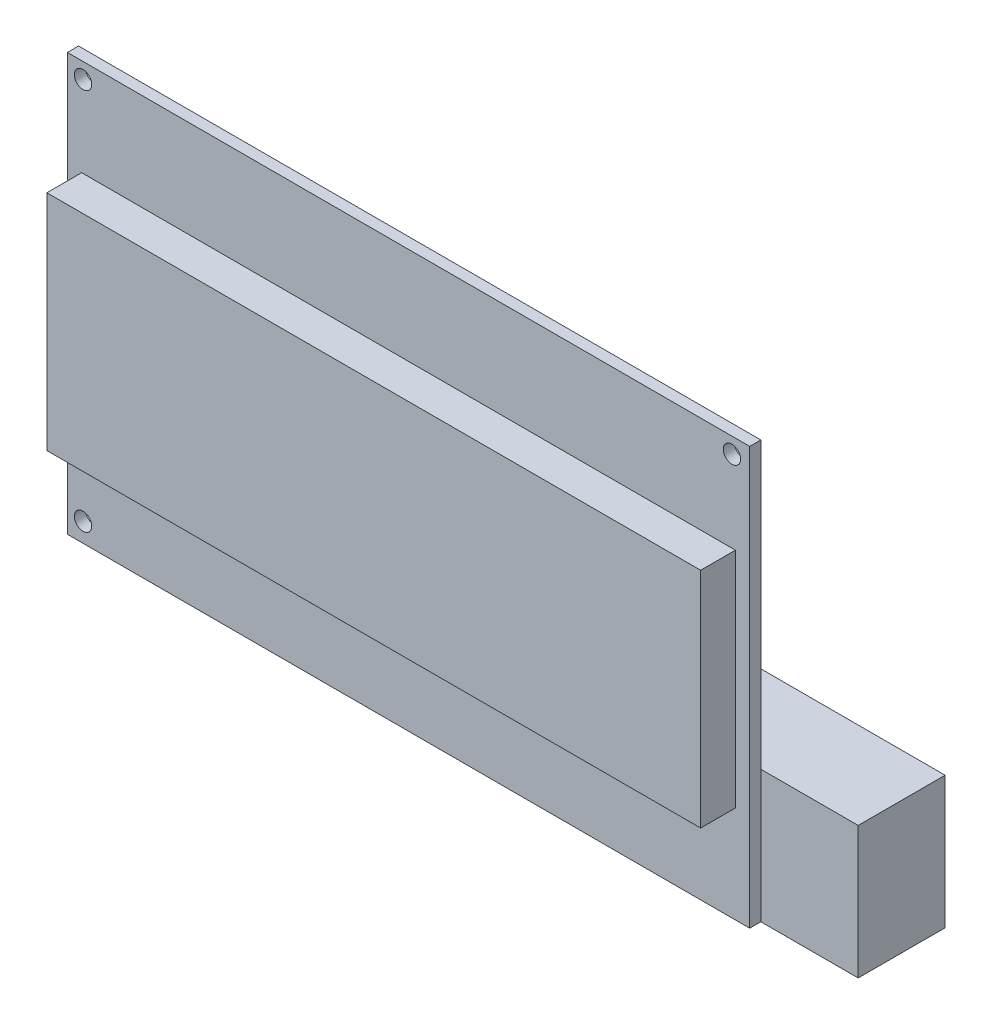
ISO-10303-21;
HEADER;
FILE_DESCRIPTION(('STEP AP214'),'2;1');
FILE_NAME('part.step','',(''),(''),'','','');
FILE_SCHEMA(('AUTOMOTIVE_DESIGN { 1 0 10303 214 1 1 1 1 }'));
ENDSEC;
DATA;
#1=APPLICATION_CONTEXT('core data for automotive mechanical design processes');
#2=APPLICATION_PROTOCOL_DEFINITION('international standard','automotive_design',2000,#1);
#3=PRODUCT_CONTEXT('',#1,'mechanical');
#4=PRODUCT('Part','Part','',(#3));
#5=PRODUCT_RELATED_PRODUCT_CATEGORY('part','',(#4));
#6=PRODUCT_DEFINITION_FORMATION('','',#4);
#7=PRODUCT_DEFINITION_CONTEXT('part definition',#1,'design');
#8=PRODUCT_DEFINITION('design','',#6,#7);
#9=PRODUCT_DEFINITION_SHAPE('','',#8);
#10=(LENGTH_UNIT() NAMED_UNIT(*) SI_UNIT(.MILLI.,.METRE.));
#11=(NAMED_UNIT(*) PLANE_ANGLE_UNIT() SI_UNIT($,.RADIAN.));
#12=(NAMED_UNIT(*) SI_UNIT($,.STERADIAN.) SOLID_ANGLE_UNIT());
#13=UNCERTAINTY_MEASURE_WITH_UNIT(LENGTH_MEASURE(1.E-05),#10,'distance_accuracy_value','');
#14=(GEOMETRIC_REPRESENTATION_CONTEXT(3) GLOBAL_UNCERTAINTY_ASSIGNED_CONTEXT((#13)) GLOBAL_UNIT_ASSIGNED_CONTEXT((#10,
#11,#12)) REPRESENTATION_CONTEXT('',''));
#15=CARTESIAN_POINT('',(0.,0.,0.));
#16=DIRECTION('',(0.,0.,1.));
#17=DIRECTION('',(1.,0.,0.));
#18=AXIS2_PLACEMENT_3D('',#15,#16,#17);
#19=CARTESIAN_POINT('',(54.1,19.,-12.5));
#20=DIRECTION('',(1.,0.,0.));
#21=DIRECTION('',(0.,0.,-1.));
#22=AXIS2_PLACEMENT_3D('',#19,#20,#21);
#23=PLANE('',#22);
#24=DIRECTION('',(0.,1.,0.));
#25=VECTOR('',#24,1.);
#26=CARTESIAN_POINT('',(54.1,19.,0.));
#27=LINE('',#26,#25);
#28=CARTESIAN_POINT('',(54.1,0.,0.));
#29=VERTEX_POINT('',#28);
#30=CARTESIAN_POINT('',(54.1,19.,0.));
#31=VERTEX_POINT('',#30);
#32=EDGE_CURVE('E217',#29,#31,#27,.T.);
#33=ORIENTED_EDGE('',*,*,#32,.T.);
#34=DIRECTION('',(0.,0.,1.));
#35=VECTOR('',#34,1.);
#36=CARTESIAN_POINT('',(54.1,19.,-12.5));
#37=LINE('',#36,#35);
#38=CARTESIAN_POINT('',(54.1,19.,-12.5));
#39=VERTEX_POINT('',#38);
#40=EDGE_CURVE('E284',#39,#31,#37,.T.);
#41=ORIENTED_EDGE('',*,*,#40,.F.);
#42=DIRECTION('',(0.,1.,0.));
#43=VECTOR('',#42,1.);
#44=CARTESIAN_POINT('',(54.1,19.,-12.5));
#45=LINE('',#44,#43);
#46=CARTESIAN_POINT('',(54.1,0.,-12.5));
#47=VERTEX_POINT('',#46);
#48=EDGE_CURVE('E202',#47,#39,#45,.T.);
#49=ORIENTED_EDGE('',*,*,#48,.F.);
#50=DIRECTION('',(0.,0.,1.));
#51=VECTOR('',#50,1.);
#52=CARTESIAN_POINT('',(54.1,0.,-12.5));
#53=LINE('',#52,#51);
#54=EDGE_CURVE('E281',#47,#29,#53,.T.);
#55=ORIENTED_EDGE('',*,*,#54,.T.);
#56=EDGE_LOOP('',(#33,#41,#49,#55));
#57=FACE_BOUND('',#56,.T.);
#58=DIRECTION('',(0.,-1.,0.));
#59=VECTOR('',#58,1.);
#60=CARTESIAN_POINT('',(54.1,12.8943157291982,-7.5));
#61=LINE('',#60,#59);
#62=CARTESIAN_POINT('',(54.1,12.8943157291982,-7.5));
#63=VERTEX_POINT('',#62);
#64=CARTESIAN_POINT('',(54.1,4.89431572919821,-7.5));
#65=VERTEX_POINT('',#64);
#66=EDGE_CURVE('E171',#63,#65,#61,.T.);
#67=ORIENTED_EDGE('',*,*,#66,.F.);
#68=DIRECTION('',(0.,0.,-1.));
#69=VECTOR('',#68,1.);
#70=CARTESIAN_POINT('',(54.1,12.8943157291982,-7.5));
#71=LINE('',#70,#69);
#72=CARTESIAN_POINT('',(54.1,12.8943157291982,-5.5));
#73=VERTEX_POINT('',#72);
#74=EDGE_CURVE('E168',#73,#63,#71,.T.);
#75=ORIENTED_EDGE('',*,*,#74,.F.);
#76=DIRECTION('',(0.,1.,0.));
#77=VECTOR('',#76,1.);
#78=CARTESIAN_POINT('',(54.1,12.8943157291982,-5.5));
#79=LINE('',#78,#77);
#80=CARTESIAN_POINT('',(54.1,4.89431572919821,-5.5));
#81=VERTEX_POINT('',#80);
#82=EDGE_CURVE('E55',#81,#73,#79,.T.);
#83=ORIENTED_EDGE('',*,*,#82,.F.);
#84=DIRECTION('',(0.,0.,1.));
#85=VECTOR('',#84,1.);
#86=CARTESIAN_POINT('',(54.1,4.89431572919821,-7.5));
#87=LINE('',#86,#85);
#88=EDGE_CURVE('E50',#65,#81,#87,.T.);
#89=ORIENTED_EDGE('',*,*,#88,.F.);
#90=EDGE_LOOP('',(#67,#75,#83,#89));
#91=FACE_BOUND('',#90,.T.);
#92=ADVANCED_FACE('F32',(#57,#91),#23,.F.);
#93=CARTESIAN_POINT('',(0.,60.,1.6));
#94=DIRECTION('',(0.,0.,-1.));
#95=DIRECTION('',(-1.,0.,0.));
#96=AXIS2_PLACEMENT_3D('',#93,#94,#95);
#97=PLANE('',#96);
#98=CARTESIAN_POINT('',(2.25,2.75,1.6));
#99=DIRECTION('',(0.,0.,-1.));
#100=DIRECTION('',(-1.,0.,0.));
#101=AXIS2_PLACEMENT_3D('',#98,#99,#100);
#102=CIRCLE('',#101,1.25);
#103=CARTESIAN_POINT('',(1.,2.75,1.6));
#104=VERTEX_POINT('',#103);
#105=EDGE_CURVE('E175',#104,#104,#102,.F.);
#106=ORIENTED_EDGE('',*,*,#105,.F.);
#107=EDGE_LOOP('',(#106));
#108=FACE_BOUND('',#107,.T.);
#109=CARTESIAN_POINT('',(95.55,57.75,1.6));
#110=DIRECTION('',(0.,0.,-1.));
#111=DIRECTION('',(-1.,0.,0.));
#112=AXIS2_PLACEMENT_3D('',#109,#110,#111);
#113=CIRCLE('',#112,1.25);
#114=CARTESIAN_POINT('',(94.3,57.75,1.6));
#115=VERTEX_POINT('',#114);
#116=EDGE_CURVE('E186',#115,#115,#113,.F.);
#117=ORIENTED_EDGE('',*,*,#116,.F.);
#118=EDGE_LOOP('',(#117));
#119=FACE_BOUND('',#118,.T.);
#120=CARTESIAN_POINT('',(2.25,57.75,1.6));
#121=DIRECTION('',(0.,0.,-1.));
#122=DIRECTION('',(-1.,0.,0.));
#123=AXIS2_PLACEMENT_3D('',#120,#121,#122);
#124=CIRCLE('',#123,1.25);
#125=CARTESIAN_POINT('',(1.,57.75,1.6));
#126=VERTEX_POINT('',#125);
#127=EDGE_CURVE('E192',#126,#126,#124,.F.);
#128=ORIENTED_EDGE('',*,*,#127,.F.);
#129=EDGE_LOOP('',(#128));
#130=FACE_BOUND('',#129,.T.);
#131=DIRECTION('',(0.,-1.,0.));
#132=VECTOR('',#131,1.);
#133=CARTESIAN_POINT('',(0.,0.,1.6));
#134=LINE('',#133,#132);
#135=CARTESIAN_POINT('',(0.,60.,1.6));
#136=VERTEX_POINT('',#135);
#137=CARTESIAN_POINT('',(0.,0.,1.6));
#138=VERTEX_POINT('',#137);
#139=EDGE_CURVE('E254',#136,#138,#134,.T.);
#140=ORIENTED_EDGE('',*,*,#139,.T.);
#141=DIRECTION('',(1.,0.,0.));
#142=VECTOR('',#141,1.);
#143=CARTESIAN_POINT('',(0.,0.,1.6));
#144=LINE('',#143,#142);
#145=CARTESIAN_POINT('',(98.1,0.,1.6));
#146=VERTEX_POINT('',#145);
#147=EDGE_CURVE('E257',#138,#146,#144,.T.);
#148=ORIENTED_EDGE('',*,*,#147,.T.);
#149=DIRECTION('',(0.,1.,0.));
#150=VECTOR('',#149,1.);
#151=CARTESIAN_POINT('',(98.1,0.,1.6));
#152=LINE('',#151,#150);
#153=CARTESIAN_POINT('',(98.1,60.,1.6));
#154=VERTEX_POINT('',#153);
#155=EDGE_CURVE('E260',#146,#154,#152,.T.);
#156=ORIENTED_EDGE('',*,*,#155,.T.);
#157=DIRECTION('',(-1.,0.,0.));
#158=VECTOR('',#157,1.);
#159=CARTESIAN_POINT('',(0.,60.,1.6));
#160=LINE('',#159,#158);
#161=EDGE_CURVE('E262',#154,#136,#160,.T.);
#162=ORIENTED_EDGE('',*,*,#161,.T.);
#163=EDGE_LOOP('',(#140,#148,#156,#162));
#164=FACE_BOUND('',#163,.T.);
#165=DIRECTION('',(0.,-1.,0.));
#166=VECTOR('',#165,1.);
#167=CARTESIAN_POINT('',(2.04999999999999,46.05,1.6));
#168=LINE('',#167,#166);
#169=CARTESIAN_POINT('',(2.04999999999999,46.05,1.6));
#170=VERTEX_POINT('',#169);
#171=CARTESIAN_POINT('',(2.05,13.95,1.6));
#172=VERTEX_POINT('',#171);
#173=EDGE_CURVE('E231',#170,#172,#168,.T.);
#174=ORIENTED_EDGE('',*,*,#173,.F.);
#175=DIRECTION('',(-1.,0.,0.));
#176=VECTOR('',#175,1.);
#177=CARTESIAN_POINT('',(2.04999999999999,46.05,1.6));
#178=LINE('',#177,#176);
#179=CARTESIAN_POINT('',(96.05,46.05,1.6));
#180=VERTEX_POINT('',#179);
#181=EDGE_CURVE('E224',#180,#170,#178,.T.);
#182=ORIENTED_EDGE('',*,*,#181,.F.);
#183=DIRECTION('',(0.,1.,0.));
#184=VECTOR('',#183,1.);
#185=CARTESIAN_POINT('',(96.05,46.05,1.6));
#186=LINE('',#185,#184);
#187=CARTESIAN_POINT('',(96.05,13.95,1.6));
#188=VERTEX_POINT('',#187);
#189=EDGE_CURVE('E237',#188,#180,#186,.T.);
#190=ORIENTED_EDGE('',*,*,#189,.F.);
#191=DIRECTION('',(1.,0.,0.));
#192=VECTOR('',#191,1.);
#193=CARTESIAN_POINT('',(2.05,13.95,1.6));
#194=LINE('',#193,#192);
#195=EDGE_CURVE('E234',#172,#188,#194,.T.);
#196=ORIENTED_EDGE('',*,*,#195,.F.);
#197=EDGE_LOOP('',(#174,#182,#190,#196));
#198=FACE_BOUND('',#197,.T.);
#199=ADVANCED_FACE('F313',(#108,#119,#130,#164,#198),#97,.F.);
#200=CARTESIAN_POINT('',(0.,0.,1.6));
#201=DIRECTION('',(1.,0.,0.));
#202=DIRECTION('',(0.,0.,-1.));
#203=AXIS2_PLACEMENT_3D('',#200,#201,#202);
#204=PLANE('',#203);
#205=DIRECTION('',(0.,-1.,0.));
#206=VECTOR('',#205,1.);
#207=CARTESIAN_POINT('',(0.,0.,0.));
#208=LINE('',#207,#206);
#209=CARTESIAN_POINT('',(0.,60.,0.));
#210=VERTEX_POINT('',#209);
#211=CARTESIAN_POINT('',(0.,0.,0.));
#212=VERTEX_POINT('',#211);
#213=EDGE_CURVE('E253',#210,#212,#208,.T.);
#214=ORIENTED_EDGE('',*,*,#213,.T.);
#215=DIRECTION('',(0.,0.,-1.));
#216=VECTOR('',#215,1.);
#217=CARTESIAN_POINT('',(0.,0.,1.6));
#218=LINE('',#217,#216);
#219=EDGE_CURVE('E11',#138,#212,#218,.T.);
#220=ORIENTED_EDGE('',*,*,#219,.F.);
#221=ORIENTED_EDGE('',*,*,#139,.F.);
#222=DIRECTION('',(0.,0.,-1.));
#223=VECTOR('',#222,1.);
#224=CARTESIAN_POINT('',(0.,60.,1.6));
#225=LINE('',#224,#223);
#226=EDGE_CURVE('E264',#136,#210,#225,.T.);
#227=ORIENTED_EDGE('',*,*,#226,.T.);
#228=EDGE_LOOP('',(#214,#220,#221,#227));
#229=FACE_BOUND('',#228,.T.);
#230=ADVANCED_FACE('F34',(#229),#204,.F.);
#231=CARTESIAN_POINT('',(0.,0.,1.6));
#232=DIRECTION('',(0.,1.,0.));
#233=DIRECTION('',(0.,0.,1.));
#234=AXIS2_PLACEMENT_3D('',#231,#232,#233);
#235=PLANE('',#234);
#236=DIRECTION('',(1.,0.,0.));
#237=VECTOR('',#236,1.);
#238=CARTESIAN_POINT('',(0.,0.,0.));
#239=LINE('',#238,#237);
#240=EDGE_CURVE('E267',#212,#29,#239,.T.);
#241=ORIENTED_EDGE('',*,*,#240,.T.);
#242=ORIENTED_EDGE('',*,*,#54,.F.);
#243=DIRECTION('',(-1.,0.,0.));
#244=VECTOR('',#243,1.);
#245=CARTESIAN_POINT('',(112.1,0.,-12.5));
#246=LINE('',#245,#244);
#247=CARTESIAN_POINT('',(112.1,0.,-12.5));
#248=VERTEX_POINT('',#247);
#249=EDGE_CURVE('E199',#248,#47,#246,.T.);
#250=ORIENTED_EDGE('',*,*,#249,.F.);
#251=DIRECTION('',(0.,0.,1.));
#252=VECTOR('',#251,1.);
#253=CARTESIAN_POINT('',(112.1,0.,-12.5));
#254=LINE('',#253,#252);
#255=CARTESIAN_POINT('',(112.1,0.,0.));
#256=VERTEX_POINT('',#255);
#257=EDGE_CURVE('E218',#248,#256,#254,.T.);
#258=ORIENTED_EDGE('',*,*,#257,.T.);
#259=DIRECTION('',(-1.,0.,0.));
#260=VECTOR('',#259,1.);
#261=CARTESIAN_POINT('',(112.1,0.,0.));
#262=LINE('',#261,#260);
#263=CARTESIAN_POINT('',(98.1,0.,0.));
#264=VERTEX_POINT('',#263);
#265=EDGE_CURVE('E209',#256,#264,#262,.T.);
#266=ORIENTED_EDGE('',*,*,#265,.T.);
#267=DIRECTION('',(0.,0.,-1.));
#268=VECTOR('',#267,1.);
#269=CARTESIAN_POINT('',(98.1,0.,1.6));
#270=LINE('',#269,#268);
#271=EDGE_CURVE('E42',#146,#264,#270,.T.);
#272=ORIENTED_EDGE('',*,*,#271,.F.);
#273=ORIENTED_EDGE('',*,*,#147,.F.);
#274=ORIENTED_EDGE('',*,*,#219,.T.);
#275=EDGE_LOOP('',(#241,#242,#250,#258,#266,#272,#273,#274));
#276=FACE_BOUND('',#275,.T.);
#277=ADVANCED_FACE('F316',(#276),#235,.F.);
#278=CARTESIAN_POINT('',(98.1,0.,1.6));
#279=DIRECTION('',(-1.,0.,0.));
#280=DIRECTION('',(0.,0.,1.));
#281=AXIS2_PLACEMENT_3D('',#278,#279,#280);
#282=PLANE('',#281);
#283=DIRECTION('',(0.,1.,0.));
#284=VECTOR('',#283,1.);
#285=CARTESIAN_POINT('',(98.1,0.,0.));
#286=LINE('',#285,#284);
#287=CARTESIAN_POINT('',(98.1,19.,0.));
#288=VERTEX_POINT('',#287);
#289=EDGE_CURVE('E36',#264,#288,#286,.T.);
#290=ORIENTED_EDGE('',*,*,#289,.T.);
#291=CARTESIAN_POINT('',(98.1,60.,0.));
#292=VERTEX_POINT('',#291);
#293=EDGE_CURVE('E269',#288,#292,#286,.T.);
#294=ORIENTED_EDGE('',*,*,#293,.T.);
#295=DIRECTION('',(0.,0.,-1.));
#296=VECTOR('',#295,1.);
#297=CARTESIAN_POINT('',(98.1,60.,1.6));
#298=LINE('',#297,#296);
#299=EDGE_CURVE('E287',#154,#292,#298,.T.);
#300=ORIENTED_EDGE('',*,*,#299,.F.);
#301=ORIENTED_EDGE('',*,*,#155,.F.);
#302=ORIENTED_EDGE('',*,*,#271,.T.);
#303=EDGE_LOOP('',(#290,#294,#300,#301,#302));
#304=FACE_BOUND('',#303,.T.);
#305=ADVANCED_FACE('F303',(#304),#282,.F.);
#306=CARTESIAN_POINT('',(0.,60.,1.6));
#307=DIRECTION('',(0.,-1.,0.));
#308=DIRECTION('',(0.,0.,-1.));
#309=AXIS2_PLACEMENT_3D('',#306,#307,#308);
#310=PLANE('',#309);
#311=DIRECTION('',(-1.,0.,0.));
#312=VECTOR('',#311,1.);
#313=CARTESIAN_POINT('',(0.,60.,0.));
#314=LINE('',#313,#312);
#315=EDGE_CURVE('E258',#292,#210,#314,.T.);
#316=ORIENTED_EDGE('',*,*,#315,.T.);
#317=ORIENTED_EDGE('',*,*,#226,.F.);
#318=ORIENTED_EDGE('',*,*,#161,.F.);
#319=ORIENTED_EDGE('',*,*,#299,.T.);
#320=EDGE_LOOP('',(#316,#317,#318,#319));
#321=FACE_BOUND('',#320,.T.);
#322=ADVANCED_FACE('F311',(#321),#310,.F.);
#323=CARTESIAN_POINT('',(0.,60.,0.));
#324=DIRECTION('',(0.,0.,-1.));
#325=DIRECTION('',(-1.,0.,0.));
#326=AXIS2_PLACEMENT_3D('',#323,#324,#325);
#327=PLANE('',#326);
#328=CARTESIAN_POINT('',(2.25,2.75,0.));
#329=DIRECTION('',(0.,0.,-1.));
#330=DIRECTION('',(-1.,0.,0.));
#331=AXIS2_PLACEMENT_3D('',#328,#329,#330);
#332=CIRCLE('',#331,1.25);
#333=CARTESIAN_POINT('',(1.,2.75,0.));
#334=VERTEX_POINT('',#333);
#335=EDGE_CURVE('E172',#334,#334,#332,.T.);
#336=ORIENTED_EDGE('',*,*,#335,.F.);
#337=EDGE_LOOP('',(#336));
#338=FACE_BOUND('',#337,.T.);
#339=CARTESIAN_POINT('',(95.55,57.75,0.));
#340=DIRECTION('',(0.,0.,-1.));
#341=DIRECTION('',(-1.,0.,0.));
#342=AXIS2_PLACEMENT_3D('',#339,#340,#341);
#343=CIRCLE('',#342,1.25);
#344=CARTESIAN_POINT('',(94.3,57.75,0.));
#345=VERTEX_POINT('',#344);
#346=EDGE_CURVE('E183',#345,#345,#343,.T.);
#347=ORIENTED_EDGE('',*,*,#346,.F.);
#348=EDGE_LOOP('',(#347));
#349=FACE_BOUND('',#348,.T.);
#350=CARTESIAN_POINT('',(2.25,57.75,0.));
#351=DIRECTION('',(0.,0.,-1.));
#352=DIRECTION('',(-1.,0.,0.));
#353=AXIS2_PLACEMENT_3D('',#350,#351,#352);
#354=CIRCLE('',#353,1.25);
#355=CARTESIAN_POINT('',(1.,57.75,0.));
#356=VERTEX_POINT('',#355);
#357=EDGE_CURVE('E189',#356,#356,#354,.T.);
#358=ORIENTED_EDGE('',*,*,#357,.F.);
#359=EDGE_LOOP('',(#358));
#360=FACE_BOUND('',#359,.T.);
#361=DIRECTION('',(1.,0.,0.));
#362=VECTOR('',#361,1.);
#363=CARTESIAN_POINT('',(112.1,19.,0.));
#364=LINE('',#363,#362);
#365=EDGE_CURVE('E200',#31,#288,#364,.T.);
#366=ORIENTED_EDGE('',*,*,#365,.F.);
#367=ORIENTED_EDGE('',*,*,#32,.F.);
#368=ORIENTED_EDGE('',*,*,#240,.F.);
#369=ORIENTED_EDGE('',*,*,#213,.F.);
#370=ORIENTED_EDGE('',*,*,#315,.F.);
#371=ORIENTED_EDGE('',*,*,#293,.F.);
#372=EDGE_LOOP('',(#366,#367,#368,#369,#370,#371));
#373=FACE_BOUND('',#372,.T.);
#374=ADVANCED_FACE('F305',(#338,#349,#360,#373),#327,.T.);
#375=CARTESIAN_POINT('',(2.04999999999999,46.05,6.6));
#376=DIRECTION('',(1.,0.,0.));
#377=DIRECTION('',(0.,1.,0.));
#378=AXIS2_PLACEMENT_3D('',#375,#376,#377);
#379=PLANE('',#378);
#380=ORIENTED_EDGE('',*,*,#173,.T.);
#381=DIRECTION('',(0.,0.,-1.));
#382=VECTOR('',#381,1.);
#383=CARTESIAN_POINT('',(2.05,13.95,6.6));
#384=LINE('',#383,#382);
#385=CARTESIAN_POINT('',(2.05,13.95,6.6));
#386=VERTEX_POINT('',#385);
#387=EDGE_CURVE('E250',#386,#172,#384,.T.);
#388=ORIENTED_EDGE('',*,*,#387,.F.);
#389=DIRECTION('',(0.,-1.,0.));
#390=VECTOR('',#389,1.);
#391=CARTESIAN_POINT('',(2.04999999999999,46.05,6.6));
#392=LINE('',#391,#390);
#393=CARTESIAN_POINT('',(2.04999999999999,46.05,6.6));
#394=VERTEX_POINT('',#393);
#395=EDGE_CURVE('E220',#394,#386,#392,.T.);
#396=ORIENTED_EDGE('',*,*,#395,.F.);
#397=DIRECTION('',(0.,0.,-1.));
#398=VECTOR('',#397,1.);
#399=CARTESIAN_POINT('',(2.04999999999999,46.05,6.6));
#400=LINE('',#399,#398);
#401=EDGE_CURVE('E230',#394,#170,#400,.T.);
#402=ORIENTED_EDGE('',*,*,#401,.T.);
#403=EDGE_LOOP('',(#380,#388,#396,#402));
#404=FACE_BOUND('',#403,.T.);
#405=ADVANCED_FACE('F401',(#404),#379,.F.);
#406=CARTESIAN_POINT('',(2.05,13.95,6.6));
#407=DIRECTION('',(0.,1.,0.));
#408=DIRECTION('',(0.,0.,1.));
#409=AXIS2_PLACEMENT_3D('',#406,#407,#408);
#410=PLANE('',#409);
#411=ORIENTED_EDGE('',*,*,#195,.T.);
#412=DIRECTION('',(0.,0.,-1.));
#413=VECTOR('',#412,1.);
#414=CARTESIAN_POINT('',(96.05,13.95,6.6));
#415=LINE('',#414,#413);
#416=CARTESIAN_POINT('',(96.05,13.95,6.6));
#417=VERTEX_POINT('',#416);
#418=EDGE_CURVE('E247',#417,#188,#415,.T.);
#419=ORIENTED_EDGE('',*,*,#418,.F.);
#420=DIRECTION('',(1.,0.,0.));
#421=VECTOR('',#420,1.);
#422=CARTESIAN_POINT('',(2.05,13.95,6.6));
#423=LINE('',#422,#421);
#424=EDGE_CURVE('E223',#386,#417,#423,.T.);
#425=ORIENTED_EDGE('',*,*,#424,.F.);
#426=ORIENTED_EDGE('',*,*,#387,.T.);
#427=EDGE_LOOP('',(#411,#419,#425,#426));
#428=FACE_BOUND('',#427,.T.);
#429=ADVANCED_FACE('F397',(#428),#410,.F.);
#430=CARTESIAN_POINT('',(96.05,46.05,6.6));
#431=DIRECTION('',(-1.,0.,0.));
#432=DIRECTION('',(0.,0.,1.));
#433=AXIS2_PLACEMENT_3D('',#430,#431,#432);
#434=PLANE('',#433);
#435=ORIENTED_EDGE('',*,*,#189,.T.);
#436=DIRECTION('',(0.,0.,-1.));
#437=VECTOR('',#436,1.);
#438=CARTESIAN_POINT('',(96.05,46.05,6.6));
#439=LINE('',#438,#437);
#440=CARTESIAN_POINT('',(96.05,46.05,6.6));
#441=VERTEX_POINT('',#440);
#442=EDGE_CURVE('E244',#441,#180,#439,.T.);
#443=ORIENTED_EDGE('',*,*,#442,.F.);
#444=DIRECTION('',(0.,1.,0.));
#445=VECTOR('',#444,1.);
#446=CARTESIAN_POINT('',(96.05,46.05,6.6));
#447=LINE('',#446,#445);
#448=EDGE_CURVE('E226',#417,#441,#447,.T.);
#449=ORIENTED_EDGE('',*,*,#448,.F.);
#450=ORIENTED_EDGE('',*,*,#418,.T.);
#451=EDGE_LOOP('',(#435,#443,#449,#450));
#452=FACE_BOUND('',#451,.T.);
#453=ADVANCED_FACE('F393',(#452),#434,.F.);
#454=CARTESIAN_POINT('',(2.04999999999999,46.05,6.6));
#455=DIRECTION('',(0.,-1.,0.));
#456=DIRECTION('',(0.,0.,-1.));
#457=AXIS2_PLACEMENT_3D('',#454,#455,#456);
#458=PLANE('',#457);
#459=ORIENTED_EDGE('',*,*,#181,.T.);
#460=ORIENTED_EDGE('',*,*,#401,.F.);
#461=DIRECTION('',(-1.,0.,0.));
#462=VECTOR('',#461,1.);
#463=CARTESIAN_POINT('',(2.04999999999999,46.05,6.6));
#464=LINE('',#463,#462);
#465=EDGE_CURVE('E228',#441,#394,#464,.T.);
#466=ORIENTED_EDGE('',*,*,#465,.F.);
#467=ORIENTED_EDGE('',*,*,#442,.T.);
#468=EDGE_LOOP('',(#459,#460,#466,#467));
#469=FACE_BOUND('',#468,.T.);
#470=ADVANCED_FACE('F389',(#469),#458,.F.);
#471=CARTESIAN_POINT('',(2.05,13.95,6.6));
#472=DIRECTION('',(0.,0.,1.));
#473=DIRECTION('',(1.,0.,0.));
#474=AXIS2_PLACEMENT_3D('',#471,#472,#473);
#475=PLANE('',#474);
#476=ORIENTED_EDGE('',*,*,#395,.T.);
#477=ORIENTED_EDGE('',*,*,#424,.T.);
#478=ORIENTED_EDGE('',*,*,#448,.T.);
#479=ORIENTED_EDGE('',*,*,#465,.T.);
#480=EDGE_LOOP('',(#476,#477,#478,#479));
#481=FACE_BOUND('',#480,.T.);
#482=ADVANCED_FACE('F386',(#481),#475,.T.);
#483=CARTESIAN_POINT('',(112.1,19.,-12.5));
#484=DIRECTION('',(-1.,0.,0.));
#485=DIRECTION('',(0.,0.,1.));
#486=AXIS2_PLACEMENT_3D('',#483,#484,#485);
#487=PLANE('',#486);
#488=DIRECTION('',(0.,-1.,0.));
#489=VECTOR('',#488,1.);
#490=CARTESIAN_POINT('',(112.1,19.,0.));
#491=LINE('',#490,#489);
#492=CARTESIAN_POINT('',(112.1,19.,0.));
#493=VERTEX_POINT('',#492);
#494=EDGE_CURVE('E195',#493,#256,#491,.T.);
#495=ORIENTED_EDGE('',*,*,#494,.T.);
#496=ORIENTED_EDGE('',*,*,#257,.F.);
#497=DIRECTION('',(0.,-1.,0.));
#498=VECTOR('',#497,1.);
#499=CARTESIAN_POINT('',(112.1,19.,-12.5));
#500=LINE('',#499,#498);
#501=CARTESIAN_POINT('',(112.1,19.,-12.5));
#502=VERTEX_POINT('',#501);
#503=EDGE_CURVE('E196',#502,#248,#500,.T.);
#504=ORIENTED_EDGE('',*,*,#503,.F.);
#505=DIRECTION('',(0.,0.,1.));
#506=VECTOR('',#505,1.);
#507=CARTESIAN_POINT('',(112.1,19.,-12.5));
#508=LINE('',#507,#506);
#509=EDGE_CURVE('E206',#502,#493,#508,.T.);
#510=ORIENTED_EDGE('',*,*,#509,.T.);
#511=EDGE_LOOP('',(#495,#496,#504,#510));
#512=FACE_BOUND('',#511,.T.);
#513=ADVANCED_FACE('F333',(#512),#487,.F.);
#514=CARTESIAN_POINT('',(112.1,19.,-12.5));
#515=DIRECTION('',(0.,-1.,0.));
#516=DIRECTION('',(0.,0.,-1.));
#517=AXIS2_PLACEMENT_3D('',#514,#515,#516);
#518=PLANE('',#517);
#519=ORIENTED_EDGE('',*,*,#365,.T.);
#520=EDGE_CURVE('E278',#288,#493,#364,.T.);
#521=ORIENTED_EDGE('',*,*,#520,.T.);
#522=ORIENTED_EDGE('',*,*,#509,.F.);
#523=DIRECTION('',(1.,0.,0.));
#524=VECTOR('',#523,1.);
#525=CARTESIAN_POINT('',(112.1,19.,-12.5));
#526=LINE('',#525,#524);
#527=EDGE_CURVE('E204',#39,#502,#526,.T.);
#528=ORIENTED_EDGE('',*,*,#527,.F.);
#529=ORIENTED_EDGE('',*,*,#40,.T.);
#530=EDGE_LOOP('',(#519,#521,#522,#528,#529));
#531=FACE_BOUND('',#530,.T.);
#532=ADVANCED_FACE('F326',(#531),#518,.F.);
#533=CARTESIAN_POINT('',(112.1,0.,-12.5));
#534=DIRECTION('',(0.,0.,-1.));
#535=DIRECTION('',(-1.,0.,0.));
#536=AXIS2_PLACEMENT_3D('',#533,#534,#535);
#537=PLANE('',#536);
#538=ORIENTED_EDGE('',*,*,#503,.T.);
#539=ORIENTED_EDGE('',*,*,#249,.T.);
#540=ORIENTED_EDGE('',*,*,#48,.T.);
#541=ORIENTED_EDGE('',*,*,#527,.T.);
#542=EDGE_LOOP('',(#538,#539,#540,#541));
#543=FACE_BOUND('',#542,.T.);
#544=ADVANCED_FACE('F335',(#543),#537,.T.);
#545=CARTESIAN_POINT('',(112.1,0.,0.));
#546=DIRECTION('',(0.,0.,-1.));
#547=DIRECTION('',(-1.,0.,0.));
#548=AXIS2_PLACEMENT_3D('',#545,#546,#547);
#549=PLANE('',#548);
#550=ORIENTED_EDGE('',*,*,#289,.F.);
#551=ORIENTED_EDGE('',*,*,#265,.F.);
#552=ORIENTED_EDGE('',*,*,#494,.F.);
#553=ORIENTED_EDGE('',*,*,#520,.F.);
#554=EDGE_LOOP('',(#550,#551,#552,#553));
#555=FACE_BOUND('',#554,.T.);
#556=ADVANCED_FACE('F321',(#555),#549,.F.);
#557=CARTESIAN_POINT('',(2.25,57.75,6.601));
#558=DIRECTION('',(0.,0.,-1.));
#559=DIRECTION('',(-1.,0.,0.));
#560=AXIS2_PLACEMENT_3D('',#557,#558,#559);
#561=CYLINDRICAL_SURFACE('',#560,1.25);
#562=ORIENTED_EDGE('',*,*,#357,.T.);
#563=EDGE_LOOP('',(#562));
#564=FACE_BOUND('',#563,.T.);
#565=ORIENTED_EDGE('',*,*,#127,.T.);
#566=EDGE_LOOP('',(#565));
#567=FACE_BOUND('',#566,.T.);
#568=ADVANCED_FACE('F373',(#564,#567),#561,.F.);
#569=CARTESIAN_POINT('',(95.55,57.75,6.601));
#570=DIRECTION('',(0.,0.,-1.));
#571=DIRECTION('',(-1.,0.,0.));
#572=AXIS2_PLACEMENT_3D('',#569,#570,#571);
#573=CYLINDRICAL_SURFACE('',#572,1.25);
#574=ORIENTED_EDGE('',*,*,#346,.T.);
#575=EDGE_LOOP('',(#574));
#576=FACE_BOUND('',#575,.T.);
#577=ORIENTED_EDGE('',*,*,#116,.T.);
#578=EDGE_LOOP('',(#577));
#579=FACE_BOUND('',#578,.T.);
#580=ADVANCED_FACE('F369',(#576,#579),#573,.F.);
#581=CARTESIAN_POINT('',(2.25,2.75,6.601));
#582=DIRECTION('',(0.,0.,-1.));
#583=DIRECTION('',(-1.,0.,0.));
#584=AXIS2_PLACEMENT_3D('',#581,#582,#583);
#585=CYLINDRICAL_SURFACE('',#584,1.25);
#586=ORIENTED_EDGE('',*,*,#335,.T.);
#587=EDGE_LOOP('',(#586));
#588=FACE_BOUND('',#587,.T.);
#589=ORIENTED_EDGE('',*,*,#105,.T.);
#590=EDGE_LOOP('',(#589));
#591=FACE_BOUND('',#590,.T.);
#592=ADVANCED_FACE('F366',(#588,#591),#585,.F.);
#593=CARTESIAN_POINT('',(48.1,12.8943157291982,-7.5));
#594=DIRECTION('',(0.,0.,1.));
#595=DIRECTION('',(0.,-1.,0.));
#596=AXIS2_PLACEMENT_3D('',#593,#594,#595);
#597=PLANE('',#596);
#598=ORIENTED_EDGE('',*,*,#66,.T.);
#599=DIRECTION('',(1.,0.,0.));
#600=VECTOR('',#599,1.);
#601=CARTESIAN_POINT('',(48.1,4.89431572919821,-7.5));
#602=LINE('',#601,#600);
#603=CARTESIAN_POINT('',(48.1,4.89431572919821,-7.5));
#604=VERTEX_POINT('',#603);
#605=EDGE_CURVE('E152',#604,#65,#602,.T.);
#606=ORIENTED_EDGE('',*,*,#605,.F.);
#607=DIRECTION('',(0.,-1.,0.));
#608=VECTOR('',#607,1.);
#609=CARTESIAN_POINT('',(48.1,12.8943157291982,-7.5));
#610=LINE('',#609,#608);
#611=CARTESIAN_POINT('',(48.1,12.8943157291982,-7.5));
#612=VERTEX_POINT('',#611);
#613=EDGE_CURVE('E159',#612,#604,#610,.T.);
#614=ORIENTED_EDGE('',*,*,#613,.F.);
#615=DIRECTION('',(1.,0.,0.));
#616=VECTOR('',#615,1.);
#617=CARTESIAN_POINT('',(48.1,12.8943157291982,-7.5));
#618=LINE('',#617,#616);
#619=EDGE_CURVE('E344',#612,#63,#618,.T.);
#620=ORIENTED_EDGE('',*,*,#619,.T.);
#621=EDGE_LOOP('',(#598,#606,#614,#620));
#622=FACE_BOUND('',#621,.T.);
#623=ADVANCED_FACE('F170',(#622),#597,.F.);
#624=CARTESIAN_POINT('',(48.1,4.89431572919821,-7.5));
#625=DIRECTION('',(0.,1.,0.));
#626=DIRECTION('',(0.,0.,1.));
#627=AXIS2_PLACEMENT_3D('',#624,#625,#626);
#628=PLANE('',#627);
#629=ORIENTED_EDGE('',*,*,#88,.T.);
#630=DIRECTION('',(1.,0.,0.));
#631=VECTOR('',#630,1.);
#632=CARTESIAN_POINT('',(48.1,4.89431572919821,-5.5));
#633=LINE('',#632,#631);
#634=CARTESIAN_POINT('',(48.1,4.89431572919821,-5.5));
#635=VERTEX_POINT('',#634);
#636=EDGE_CURVE('E155',#635,#81,#633,.T.);
#637=ORIENTED_EDGE('',*,*,#636,.F.);
#638=DIRECTION('',(0.,0.,1.));
#639=VECTOR('',#638,1.);
#640=CARTESIAN_POINT('',(48.1,4.89431572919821,-7.5));
#641=LINE('',#640,#639);
#642=EDGE_CURVE('E148',#604,#635,#641,.T.);
#643=ORIENTED_EDGE('',*,*,#642,.F.);
#644=ORIENTED_EDGE('',*,*,#605,.T.);
#645=EDGE_LOOP('',(#629,#637,#643,#644));
#646=FACE_BOUND('',#645,.T.);
#647=ADVANCED_FACE('F150',(#646),#628,.F.);
#648=CARTESIAN_POINT('',(48.1,12.8943157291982,-5.5));
#649=DIRECTION('',(0.,0.,-1.));
#650=DIRECTION('',(0.,1.,0.));
#651=AXIS2_PLACEMENT_3D('',#648,#649,#650);
#652=PLANE('',#651);
#653=ORIENTED_EDGE('',*,*,#82,.T.);
#654=DIRECTION('',(1.,0.,0.));
#655=VECTOR('',#654,1.);
#656=CARTESIAN_POINT('',(48.1,12.8943157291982,-5.5));
#657=LINE('',#656,#655);
#658=CARTESIAN_POINT('',(48.1,12.8943157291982,-5.5));
#659=VERTEX_POINT('',#658);
#660=EDGE_CURVE('E177',#659,#73,#657,.T.);
#661=ORIENTED_EDGE('',*,*,#660,.F.);
#662=DIRECTION('',(0.,1.,0.));
#663=VECTOR('',#662,1.);
#664=CARTESIAN_POINT('',(48.1,12.8943157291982,-5.5));
#665=LINE('',#664,#663);
#666=EDGE_CURVE('E158',#635,#659,#665,.T.);
#667=ORIENTED_EDGE('',*,*,#666,.F.);
#668=ORIENTED_EDGE('',*,*,#636,.T.);
#669=EDGE_LOOP('',(#653,#661,#667,#668));
#670=FACE_BOUND('',#669,.T.);
#671=ADVANCED_FACE('F353',(#670),#652,.F.);
#672=CARTESIAN_POINT('',(48.1,12.8943157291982,-7.5));
#673=DIRECTION('',(0.,-1.,0.));
#674=DIRECTION('',(0.,0.,-1.));
#675=AXIS2_PLACEMENT_3D('',#672,#673,#674);
#676=PLANE('',#675);
#677=ORIENTED_EDGE('',*,*,#74,.T.);
#678=ORIENTED_EDGE('',*,*,#619,.F.);
#679=DIRECTION('',(0.,0.,-1.));
#680=VECTOR('',#679,1.);
#681=CARTESIAN_POINT('',(48.1,12.8943157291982,-7.5));
#682=LINE('',#681,#680);
#683=EDGE_CURVE('E164',#659,#612,#682,.T.);
#684=ORIENTED_EDGE('',*,*,#683,.F.);
#685=ORIENTED_EDGE('',*,*,#660,.T.);
#686=EDGE_LOOP('',(#677,#678,#684,#685));
#687=FACE_BOUND('',#686,.T.);
#688=ADVANCED_FACE('F343',(#687),#676,.F.);
#689=CARTESIAN_POINT('',(48.1,4.89431572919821,-7.5));
#690=DIRECTION('',(-1.,0.,0.));
#691=DIRECTION('',(0.,0.,1.));
#692=AXIS2_PLACEMENT_3D('',#689,#690,#691);
#693=PLANE('',#692);
#694=ORIENTED_EDGE('',*,*,#613,.T.);
#695=ORIENTED_EDGE('',*,*,#642,.T.);
#696=ORIENTED_EDGE('',*,*,#666,.T.);
#697=ORIENTED_EDGE('',*,*,#683,.T.);
#698=EDGE_LOOP('',(#694,#695,#696,#697));
#699=FACE_BOUND('',#698,.T.);
#700=ADVANCED_FACE('F162',(#699),#693,.T.);
#701=CLOSED_SHELL('',(#92,#199,#230,#277,#305,#322,#374,#405,#429,#453,#470,#482,#513,#532,#544,
#556,#568,#580,#592,#623,#647,#671,#688,#700));
#702=MANIFOLD_SOLID_BREP('B2',#701);
#703=ADVANCED_BREP_SHAPE_REPRESENTATION('',(#18,#702),#14);
#704=SHAPE_DEFINITION_REPRESENTATION(#9,#703);
ENDSEC;
END-ISO-10303-21;
